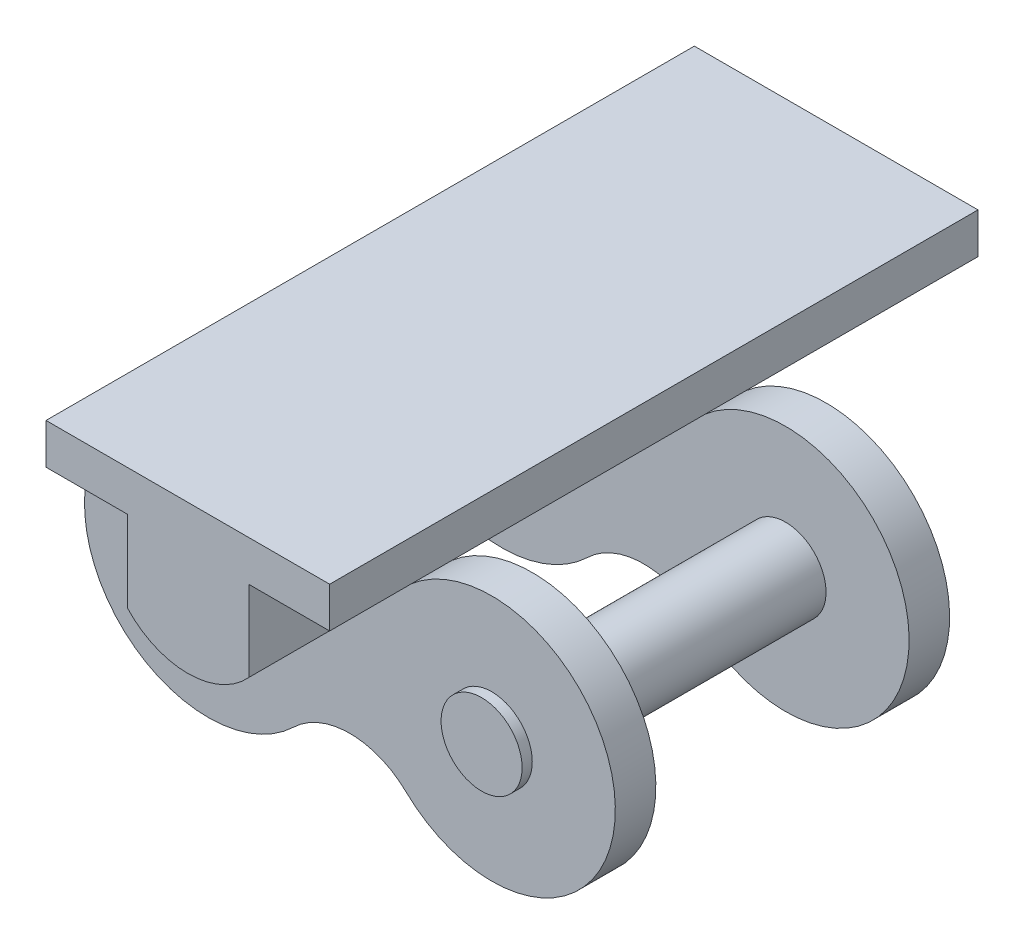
ISO-10303-21;
HEADER;
FILE_DESCRIPTION(('STEP AP214'),'2;1');
FILE_NAME('part.step','',(''),(''),'','','');
FILE_SCHEMA(('AUTOMOTIVE_DESIGN { 1 0 10303 214 1 1 1 1 }'));
ENDSEC;
DATA;
#1=APPLICATION_CONTEXT('core data for automotive mechanical design processes');
#2=APPLICATION_PROTOCOL_DEFINITION('international standard','automotive_design',2000,#1);
#3=PRODUCT_CONTEXT('',#1,'mechanical');
#4=PRODUCT('Part','Part','',(#3));
#5=PRODUCT_RELATED_PRODUCT_CATEGORY('part','',(#4));
#6=PRODUCT_DEFINITION_FORMATION('','',#4);
#7=PRODUCT_DEFINITION_CONTEXT('part definition',#1,'design');
#8=PRODUCT_DEFINITION('design','',#6,#7);
#9=PRODUCT_DEFINITION_SHAPE('','',#8);
#10=(LENGTH_UNIT() NAMED_UNIT(*) SI_UNIT(.MILLI.,.METRE.));
#11=(NAMED_UNIT(*) PLANE_ANGLE_UNIT() SI_UNIT($,.RADIAN.));
#12=(NAMED_UNIT(*) SI_UNIT($,.STERADIAN.) SOLID_ANGLE_UNIT());
#13=UNCERTAINTY_MEASURE_WITH_UNIT(LENGTH_MEASURE(1.E-05),#10,'distance_accuracy_value','');
#14=(GEOMETRIC_REPRESENTATION_CONTEXT(3) GLOBAL_UNCERTAINTY_ASSIGNED_CONTEXT((#13)) GLOBAL_UNIT_ASSIGNED_CONTEXT((#10,
#11,#12)) REPRESENTATION_CONTEXT('',''));
#15=CARTESIAN_POINT('',(0.,0.,0.));
#16=DIRECTION('',(0.,0.,1.));
#17=DIRECTION('',(1.,0.,0.));
#18=AXIS2_PLACEMENT_3D('',#15,#16,#17);
#19=CARTESIAN_POINT('',(3.5,3.64039832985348,2.));
#20=DIRECTION('',(0.,0.,1.));
#21=DIRECTION('',(1.,0.,0.));
#22=AXIS2_PLACEMENT_3D('',#19,#20,#21);
#23=PLANE('',#22);
#24=CARTESIAN_POINT('',(-7.,0.,2.));
#25=DIRECTION('',(0.,0.,1.));
#26=DIRECTION('',(1.,0.,0.));
#27=AXIS2_PLACEMENT_3D('',#24,#25,#26);
#28=CIRCLE('',#27,2.);
#29=CARTESIAN_POINT('',(-5.,0.,2.));
#30=VERTEX_POINT('',#29);
#31=EDGE_CURVE('E327',#30,#30,#28,.T.);
#32=ORIENTED_EDGE('',*,*,#31,.F.);
#33=EDGE_LOOP('',(#32));
#34=FACE_BOUND('',#33,.T.);
#35=CARTESIAN_POINT('',(7.,0.,2.));
#36=DIRECTION('',(0.,0.,1.));
#37=DIRECTION('',(-1.,0.,0.));
#38=AXIS2_PLACEMENT_3D('',#35,#36,#37);
#39=CIRCLE('',#38,2.);
#40=CARTESIAN_POINT('',(5.,0.,2.));
#41=VERTEX_POINT('',#40);
#42=EDGE_CURVE('E323',#41,#41,#39,.T.);
#43=ORIENTED_EDGE('',*,*,#42,.F.);
#44=EDGE_LOOP('',(#43));
#45=FACE_BOUND('',#44,.T.);
#46=CARTESIAN_POINT('',(7.,0.,2.));
#47=DIRECTION('',(0.,0.,1.));
#48=DIRECTION('',(-1.,0.,0.));
#49=AXIS2_PLACEMENT_3D('',#46,#47,#48);
#50=CIRCLE('',#49,6.1);
#51=CARTESIAN_POINT('',(2.77227722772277,-4.39731283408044,2.));
#52=VERTEX_POINT('',#51);
#53=CARTESIAN_POINT('',(3.01043166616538,4.6144712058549,2.));
#54=VERTEX_POINT('',#53);
#55=EDGE_CURVE('E339',#52,#54,#50,.T.);
#56=ORIENTED_EDGE('',*,*,#55,.T.);
#57=CARTESIAN_POINT('',(0.00217211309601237,7.34025454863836,2.));
#58=DIRECTION('',(0.,0.,1.));
#59=DIRECTION('',(1.,0.,0.));
#60=AXIS2_PLACEMENT_3D('',#57,#58,#59);
#61=CIRCLE('',#60,4.05949755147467);
#62=CARTESIAN_POINT('',(-2.98956833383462,4.59635049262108,2.));
#63=VERTEX_POINT('',#62);
#64=EDGE_CURVE('E55',#54,#63,#61,.F.);
#65=ORIENTED_EDGE('',*,*,#64,.T.);
#66=CARTESIAN_POINT('',(-7.,0.,2.));
#67=DIRECTION('',(0.,0.,1.));
#68=DIRECTION('',(1.,0.,0.));
#69=AXIS2_PLACEMENT_3D('',#66,#67,#68);
#70=CIRCLE('',#69,6.1);
#71=CARTESIAN_POINT('',(-2.77227722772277,-4.39731283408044,2.));
#72=VERTEX_POINT('',#71);
#73=EDGE_CURVE('E332',#63,#72,#70,.T.);
#74=ORIENTED_EDGE('',*,*,#73,.T.);
#75=CARTESIAN_POINT('',(0.,-7.28079665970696,2.));
#76=DIRECTION('',(0.,0.,-1.));
#77=DIRECTION('',(-1.,0.,0.));
#78=AXIS2_PLACEMENT_3D('',#75,#76,#77);
#79=CIRCLE('',#78,4.);
#80=EDGE_CURVE('E335',#72,#52,#79,.T.);
#81=ORIENTED_EDGE('',*,*,#80,.T.);
#82=EDGE_LOOP('',(#56,#65,#74,#81));
#83=FACE_BOUND('',#82,.T.);
#84=ADVANCED_FACE('F39',(#34,#45,#83),#23,.T.);
#85=CARTESIAN_POINT('',(3.5,3.64039832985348,0.));
#86=DIRECTION('',(0.,0.,1.));
#87=DIRECTION('',(1.,0.,0.));
#88=AXIS2_PLACEMENT_3D('',#85,#86,#87);
#89=PLANE('',#88);
#90=CARTESIAN_POINT('',(-7.,0.,0.));
#91=DIRECTION('',(0.,0.,1.));
#92=DIRECTION('',(1.,0.,0.));
#93=AXIS2_PLACEMENT_3D('',#90,#91,#92);
#94=CIRCLE('',#93,2.);
#95=CARTESIAN_POINT('',(-5.,0.,0.));
#96=VERTEX_POINT('',#95);
#97=EDGE_CURVE('E307',#96,#96,#94,.T.);
#98=ORIENTED_EDGE('',*,*,#97,.T.);
#99=EDGE_LOOP('',(#98));
#100=FACE_BOUND('',#99,.T.);
#101=CARTESIAN_POINT('',(7.,0.,0.));
#102=DIRECTION('',(0.,0.,1.));
#103=DIRECTION('',(1.,0.,0.));
#104=AXIS2_PLACEMENT_3D('',#101,#102,#103);
#105=CIRCLE('',#104,2.);
#106=CARTESIAN_POINT('',(9.,0.,0.));
#107=VERTEX_POINT('',#106);
#108=EDGE_CURVE('E319',#107,#107,#105,.T.);
#109=ORIENTED_EDGE('',*,*,#108,.T.);
#110=EDGE_LOOP('',(#109));
#111=FACE_BOUND('',#110,.T.);
#112=CARTESIAN_POINT('',(0.00217211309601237,7.34025454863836,0.));
#113=DIRECTION('',(0.,0.,1.));
#114=DIRECTION('',(1.,0.,0.));
#115=AXIS2_PLACEMENT_3D('',#112,#113,#114);
#116=CIRCLE('',#115,4.05949755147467);
#117=CARTESIAN_POINT('',(3.01043166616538,4.6144712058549,0.));
#118=VERTEX_POINT('',#117);
#119=CARTESIAN_POINT('',(-2.98956833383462,4.59635049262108,0.));
#120=VERTEX_POINT('',#119);
#121=EDGE_CURVE('E63',#118,#120,#116,.F.);
#122=ORIENTED_EDGE('',*,*,#121,.F.);
#123=CARTESIAN_POINT('',(7.,0.,0.));
#124=DIRECTION('',(0.,0.,1.));
#125=DIRECTION('',(-1.,0.,0.));
#126=AXIS2_PLACEMENT_3D('',#123,#124,#125);
#127=CIRCLE('',#126,6.1);
#128=CARTESIAN_POINT('',(2.77227722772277,-4.39731283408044,0.));
#129=VERTEX_POINT('',#128);
#130=EDGE_CURVE('E336',#129,#118,#127,.T.);
#131=ORIENTED_EDGE('',*,*,#130,.F.);
#132=CARTESIAN_POINT('',(0.,-7.28079665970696,0.));
#133=DIRECTION('',(0.,0.,-1.));
#134=DIRECTION('',(-1.,0.,0.));
#135=AXIS2_PLACEMENT_3D('',#132,#133,#134);
#136=CIRCLE('',#135,4.);
#137=CARTESIAN_POINT('',(-2.77227722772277,-4.39731283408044,0.));
#138=VERTEX_POINT('',#137);
#139=EDGE_CURVE('E345',#138,#129,#136,.T.);
#140=ORIENTED_EDGE('',*,*,#139,.F.);
#141=CARTESIAN_POINT('',(-7.,0.,0.));
#142=DIRECTION('',(0.,0.,1.));
#143=DIRECTION('',(1.,0.,0.));
#144=AXIS2_PLACEMENT_3D('',#141,#142,#143);
#145=CIRCLE('',#144,6.1);
#146=EDGE_CURVE('E331',#120,#138,#145,.T.);
#147=ORIENTED_EDGE('',*,*,#146,.F.);
#148=EDGE_LOOP('',(#122,#131,#140,#147));
#149=FACE_BOUND('',#148,.T.);
#150=ADVANCED_FACE('F377',(#100,#111,#149),#89,.F.);
#151=CARTESIAN_POINT('',(-7.,0.,2.));
#152=DIRECTION('',(0.,0.,-1.));
#153=DIRECTION('',(-1.,0.,0.));
#154=AXIS2_PLACEMENT_3D('',#151,#152,#153);
#155=CYLINDRICAL_SURFACE('',#154,6.1);
#156=DIRECTION('',(0.,0.,-1.));
#157=VECTOR('',#156,1.);
#158=CARTESIAN_POINT('',(-2.98956833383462,4.59635049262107,24.5));
#159=LINE('',#158,#157);
#160=EDGE_CURVE('E400',#63,#120,#159,.T.);
#161=ORIENTED_EDGE('',*,*,#160,.T.);
#162=ORIENTED_EDGE('',*,*,#146,.T.);
#163=DIRECTION('',(0.,0.,-1.));
#164=VECTOR('',#163,1.);
#165=CARTESIAN_POINT('',(-2.77227722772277,-4.39731283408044,2.));
#166=LINE('',#165,#164);
#167=EDGE_CURVE('E353',#72,#138,#166,.T.);
#168=ORIENTED_EDGE('',*,*,#167,.F.);
#169=ORIENTED_EDGE('',*,*,#73,.F.);
#170=EDGE_LOOP('',(#161,#162,#168,#169));
#171=FACE_BOUND('',#170,.T.);
#172=ADVANCED_FACE('F41',(#171),#155,.T.);
#173=CARTESIAN_POINT('',(7.,0.,2.));
#174=DIRECTION('',(0.,0.,-1.));
#175=DIRECTION('',(-1.,0.,0.));
#176=AXIS2_PLACEMENT_3D('',#173,#174,#175);
#177=CYLINDRICAL_SURFACE('',#176,6.1);
#178=DIRECTION('',(0.,0.,-1.));
#179=VECTOR('',#178,1.);
#180=CARTESIAN_POINT('',(3.01043166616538,4.6144712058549,24.5));
#181=LINE('',#180,#179);
#182=EDGE_CURVE('E162',#54,#118,#181,.T.);
#183=ORIENTED_EDGE('',*,*,#182,.F.);
#184=ORIENTED_EDGE('',*,*,#55,.F.);
#185=DIRECTION('',(0.,0.,-1.));
#186=VECTOR('',#185,1.);
#187=CARTESIAN_POINT('',(2.77227722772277,-4.39731283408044,2.));
#188=LINE('',#187,#186);
#189=EDGE_CURVE('E342',#52,#129,#188,.T.);
#190=ORIENTED_EDGE('',*,*,#189,.T.);
#191=ORIENTED_EDGE('',*,*,#130,.T.);
#192=EDGE_LOOP('',(#183,#184,#190,#191));
#193=FACE_BOUND('',#192,.T.);
#194=ADVANCED_FACE('F477',(#193),#177,.T.);
#195=CARTESIAN_POINT('',(7.,0.,14.5));
#196=DIRECTION('',(0.,0.,1.));
#197=DIRECTION('',(1.,0.,0.));
#198=AXIS2_PLACEMENT_3D('',#195,#196,#197);
#199=CYLINDRICAL_SURFACE('',#198,6.1);
#200=CARTESIAN_POINT('',(7.,0.,14.5));
#201=DIRECTION('',(0.,0.,1.));
#202=DIRECTION('',(-1.,0.,0.));
#203=AXIS2_PLACEMENT_3D('',#200,#201,#202);
#204=CIRCLE('',#203,6.1);
#205=CARTESIAN_POINT('',(2.77227722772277,-4.39731283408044,14.5));
#206=VERTEX_POINT('',#205);
#207=CARTESIAN_POINT('',(3.01043166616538,4.61447120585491,14.5));
#208=VERTEX_POINT('',#207);
#209=EDGE_CURVE('E272',#206,#208,#204,.T.);
#210=ORIENTED_EDGE('',*,*,#209,.T.);
#211=CARTESIAN_POINT('',(3.01043166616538,4.6144712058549,16.5));
#212=VERTEX_POINT('',#211);
#213=EDGE_CURVE('E256',#212,#208,#181,.T.);
#214=ORIENTED_EDGE('',*,*,#213,.F.);
#215=CARTESIAN_POINT('',(7.,0.,16.5));
#216=DIRECTION('',(0.,0.,1.));
#217=DIRECTION('',(-1.,0.,0.));
#218=AXIS2_PLACEMENT_3D('',#215,#216,#217);
#219=CIRCLE('',#218,6.1);
#220=CARTESIAN_POINT('',(2.77227722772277,-4.39731283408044,16.5));
#221=VERTEX_POINT('',#220);
#222=EDGE_CURVE('E271',#221,#212,#219,.T.);
#223=ORIENTED_EDGE('',*,*,#222,.F.);
#224=DIRECTION('',(0.,0.,1.));
#225=VECTOR('',#224,1.);
#226=CARTESIAN_POINT('',(2.77227722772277,-4.39731283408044,14.5));
#227=LINE('',#226,#225);
#228=EDGE_CURVE('E296',#206,#221,#227,.T.);
#229=ORIENTED_EDGE('',*,*,#228,.F.);
#230=EDGE_LOOP('',(#210,#214,#223,#229));
#231=FACE_BOUND('',#230,.T.);
#232=ADVANCED_FACE('F456',(#231),#199,.T.);
#233=CARTESIAN_POINT('',(-7.,0.,14.5));
#234=DIRECTION('',(0.,0.,1.));
#235=DIRECTION('',(1.,0.,0.));
#236=AXIS2_PLACEMENT_3D('',#233,#234,#235);
#237=CYLINDRICAL_SURFACE('',#236,6.1);
#238=CARTESIAN_POINT('',(-7.,0.,16.5));
#239=DIRECTION('',(0.,0.,1.));
#240=DIRECTION('',(1.,0.,0.));
#241=AXIS2_PLACEMENT_3D('',#238,#239,#240);
#242=CIRCLE('',#241,6.1);
#243=CARTESIAN_POINT('',(-2.98956833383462,4.59635049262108,16.5));
#244=VERTEX_POINT('',#243);
#245=CARTESIAN_POINT('',(-2.77227722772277,-4.39731283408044,16.5));
#246=VERTEX_POINT('',#245);
#247=EDGE_CURVE('E277',#244,#246,#242,.T.);
#248=ORIENTED_EDGE('',*,*,#247,.F.);
#249=CARTESIAN_POINT('',(-2.98956833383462,4.59635049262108,14.5));
#250=VERTEX_POINT('',#249);
#251=EDGE_CURVE('E237',#244,#250,#159,.T.);
#252=ORIENTED_EDGE('',*,*,#251,.T.);
#253=CARTESIAN_POINT('',(-7.,0.,14.5));
#254=DIRECTION('',(0.,0.,1.));
#255=DIRECTION('',(1.,0.,0.));
#256=AXIS2_PLACEMENT_3D('',#253,#254,#255);
#257=CIRCLE('',#256,6.1);
#258=CARTESIAN_POINT('',(-2.77227722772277,-4.39731283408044,14.5));
#259=VERTEX_POINT('',#258);
#260=EDGE_CURVE('E281',#250,#259,#257,.T.);
#261=ORIENTED_EDGE('',*,*,#260,.T.);
#262=DIRECTION('',(0.,0.,1.));
#263=VECTOR('',#262,1.);
#264=CARTESIAN_POINT('',(-2.77227722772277,-4.39731283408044,14.5));
#265=LINE('',#264,#263);
#266=EDGE_CURVE('E284',#259,#246,#265,.T.);
#267=ORIENTED_EDGE('',*,*,#266,.T.);
#268=EDGE_LOOP('',(#248,#252,#261,#267));
#269=FACE_BOUND('',#268,.T.);
#270=ADVANCED_FACE('F447',(#269),#237,.T.);
#271=CARTESIAN_POINT('',(3.5,3.64039832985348,14.5));
#272=DIRECTION('',(0.,0.,-1.));
#273=DIRECTION('',(1.,0.,0.));
#274=AXIS2_PLACEMENT_3D('',#271,#272,#273);
#275=PLANE('',#274);
#276=CARTESIAN_POINT('',(7.,0.,14.5));
#277=DIRECTION('',(0.,0.,-1.));
#278=DIRECTION('',(-1.,0.,0.));
#279=AXIS2_PLACEMENT_3D('',#276,#277,#278);
#280=CIRCLE('',#279,2.);
#281=CARTESIAN_POINT('',(5.,0.,14.5));
#282=VERTEX_POINT('',#281);
#283=EDGE_CURVE('E48',#282,#282,#280,.F.);
#284=ORIENTED_EDGE('',*,*,#283,.T.);
#285=EDGE_LOOP('',(#284));
#286=FACE_BOUND('',#285,.T.);
#287=CARTESIAN_POINT('',(-7.,0.,14.5));
#288=DIRECTION('',(0.,0.,-1.));
#289=DIRECTION('',(-1.,0.,0.));
#290=AXIS2_PLACEMENT_3D('',#287,#288,#289);
#291=CIRCLE('',#290,2.);
#292=CARTESIAN_POINT('',(-9.,0.,14.5));
#293=VERTEX_POINT('',#292);
#294=EDGE_CURVE('E357',#293,#293,#291,.F.);
#295=ORIENTED_EDGE('',*,*,#294,.T.);
#296=EDGE_LOOP('',(#295));
#297=FACE_BOUND('',#296,.T.);
#298=ORIENTED_EDGE('',*,*,#260,.F.);
#299=CARTESIAN_POINT('',(0.00217211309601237,7.34025454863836,14.5));
#300=DIRECTION('',(0.,0.,-1.));
#301=DIRECTION('',(-1.,0.,0.));
#302=AXIS2_PLACEMENT_3D('',#299,#300,#301);
#303=CIRCLE('',#302,4.05949755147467);
#304=EDGE_CURVE('E255',#250,#208,#303,.F.);
#305=ORIENTED_EDGE('',*,*,#304,.T.);
#306=ORIENTED_EDGE('',*,*,#209,.F.);
#307=CARTESIAN_POINT('',(0.,-7.28079665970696,14.5));
#308=DIRECTION('',(0.,0.,-1.));
#309=DIRECTION('',(-1.,0.,0.));
#310=AXIS2_PLACEMENT_3D('',#307,#308,#309);
#311=CIRCLE('',#310,4.);
#312=EDGE_CURVE('E276',#259,#206,#311,.T.);
#313=ORIENTED_EDGE('',*,*,#312,.F.);
#314=EDGE_LOOP('',(#298,#305,#306,#313));
#315=FACE_BOUND('',#314,.T.);
#316=ADVANCED_FACE('F364',(#286,#297,#315),#275,.T.);
#317=CARTESIAN_POINT('',(3.5,3.64039832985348,16.5));
#318=DIRECTION('',(0.,0.,-1.));
#319=DIRECTION('',(1.,0.,0.));
#320=AXIS2_PLACEMENT_3D('',#317,#318,#319);
#321=PLANE('',#320);
#322=CARTESIAN_POINT('',(7.,0.,16.5));
#323=DIRECTION('',(0.,0.,1.));
#324=DIRECTION('',(-1.,0.,0.));
#325=AXIS2_PLACEMENT_3D('',#322,#323,#324);
#326=CIRCLE('',#325,2.);
#327=CARTESIAN_POINT('',(5.,0.,16.5));
#328=VERTEX_POINT('',#327);
#329=EDGE_CURVE('E263',#328,#328,#326,.T.);
#330=ORIENTED_EDGE('',*,*,#329,.F.);
#331=EDGE_LOOP('',(#330));
#332=FACE_BOUND('',#331,.T.);
#333=CARTESIAN_POINT('',(-7.,0.,16.5));
#334=DIRECTION('',(0.,0.,1.));
#335=DIRECTION('',(1.,0.,0.));
#336=AXIS2_PLACEMENT_3D('',#333,#334,#335);
#337=CIRCLE('',#336,2.);
#338=CARTESIAN_POINT('',(-5.,0.,16.5));
#339=VERTEX_POINT('',#338);
#340=EDGE_CURVE('E267',#339,#339,#337,.T.);
#341=ORIENTED_EDGE('',*,*,#340,.F.);
#342=EDGE_LOOP('',(#341));
#343=FACE_BOUND('',#342,.T.);
#344=CARTESIAN_POINT('',(0.00217211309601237,7.34025454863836,16.5));
#345=DIRECTION('',(0.,0.,-1.));
#346=DIRECTION('',(-1.,0.,0.));
#347=AXIS2_PLACEMENT_3D('',#344,#345,#346);
#348=CIRCLE('',#347,4.05949755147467);
#349=EDGE_CURVE('E11',#244,#212,#348,.F.);
#350=ORIENTED_EDGE('',*,*,#349,.F.);
#351=ORIENTED_EDGE('',*,*,#247,.T.);
#352=CARTESIAN_POINT('',(0.,-7.28079665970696,16.5));
#353=DIRECTION('',(0.,0.,-1.));
#354=DIRECTION('',(-1.,0.,0.));
#355=AXIS2_PLACEMENT_3D('',#352,#353,#354);
#356=CIRCLE('',#355,4.);
#357=EDGE_CURVE('E287',#246,#221,#356,.T.);
#358=ORIENTED_EDGE('',*,*,#357,.T.);
#359=ORIENTED_EDGE('',*,*,#222,.T.);
#360=EDGE_LOOP('',(#350,#351,#358,#359));
#361=FACE_BOUND('',#360,.T.);
#362=ADVANCED_FACE('F443',(#332,#343,#361),#321,.F.);
#363=CARTESIAN_POINT('',(0.,-7.28079665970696,2.));
#364=DIRECTION('',(0.,0.,-1.));
#365=DIRECTION('',(-1.,0.,0.));
#366=AXIS2_PLACEMENT_3D('',#363,#364,#365);
#367=CYLINDRICAL_SURFACE('',#366,4.);
#368=ORIENTED_EDGE('',*,*,#139,.T.);
#369=ORIENTED_EDGE('',*,*,#189,.F.);
#370=ORIENTED_EDGE('',*,*,#80,.F.);
#371=ORIENTED_EDGE('',*,*,#167,.T.);
#372=EDGE_LOOP('',(#368,#369,#370,#371));
#373=FACE_BOUND('',#372,.T.);
#374=ADVANCED_FACE('F464',(#373),#367,.F.);
#375=CARTESIAN_POINT('',(7.,0.,-0.5));
#376=DIRECTION('',(0.,0.,1.));
#377=DIRECTION('',(1.,0.,0.));
#378=AXIS2_PLACEMENT_3D('',#375,#376,#377);
#379=PLANE('',#378);
#380=CARTESIAN_POINT('',(7.,0.,-0.5));
#381=DIRECTION('',(0.,0.,1.));
#382=DIRECTION('',(1.,0.,0.));
#383=AXIS2_PLACEMENT_3D('',#380,#381,#382);
#384=CIRCLE('',#383,2.);
#385=CARTESIAN_POINT('',(9.,0.,-0.5));
#386=VERTEX_POINT('',#385);
#387=EDGE_CURVE('E315',#386,#386,#384,.T.);
#388=ORIENTED_EDGE('',*,*,#387,.F.);
#389=EDGE_LOOP('',(#388));
#390=FACE_BOUND('',#389,.T.);
#391=ADVANCED_FACE('F493',(#390),#379,.F.);
#392=CARTESIAN_POINT('',(7.,0.,-0.5));
#393=DIRECTION('',(0.,0.,1.));
#394=DIRECTION('',(1.,0.,0.));
#395=AXIS2_PLACEMENT_3D('',#392,#393,#394);
#396=CYLINDRICAL_SURFACE('',#395,2.);
#397=ORIENTED_EDGE('',*,*,#387,.T.);
#398=EDGE_LOOP('',(#397));
#399=FACE_BOUND('',#398,.T.);
#400=ORIENTED_EDGE('',*,*,#108,.F.);
#401=EDGE_LOOP('',(#400));
#402=FACE_BOUND('',#401,.T.);
#403=ADVANCED_FACE('F371',(#399,#402),#396,.T.);
#404=ORIENTED_EDGE('',*,*,#283,.F.);
#405=EDGE_LOOP('',(#404));
#406=FACE_BOUND('',#405,.T.);
#407=ORIENTED_EDGE('',*,*,#42,.T.);
#408=EDGE_LOOP('',(#407));
#409=FACE_BOUND('',#408,.T.);
#410=ADVANCED_FACE('F367',(#406,#409),#396,.T.);
#411=CARTESIAN_POINT('',(-7.,0.,-0.5));
#412=DIRECTION('',(0.,0.,1.));
#413=DIRECTION('',(1.,0.,0.));
#414=AXIS2_PLACEMENT_3D('',#411,#412,#413);
#415=PLANE('',#414);
#416=CARTESIAN_POINT('',(-7.,0.,-0.5));
#417=DIRECTION('',(0.,0.,1.));
#418=DIRECTION('',(1.,0.,0.));
#419=AXIS2_PLACEMENT_3D('',#416,#417,#418);
#420=CIRCLE('',#419,2.);
#421=CARTESIAN_POINT('',(-5.,0.,-0.5));
#422=VERTEX_POINT('',#421);
#423=EDGE_CURVE('E303',#422,#422,#420,.T.);
#424=ORIENTED_EDGE('',*,*,#423,.F.);
#425=EDGE_LOOP('',(#424));
#426=FACE_BOUND('',#425,.T.);
#427=ADVANCED_FACE('F370',(#426),#415,.F.);
#428=CARTESIAN_POINT('',(-7.,0.,-0.5));
#429=DIRECTION('',(0.,0.,1.));
#430=DIRECTION('',(1.,0.,0.));
#431=AXIS2_PLACEMENT_3D('',#428,#429,#430);
#432=CYLINDRICAL_SURFACE('',#431,2.);
#433=ORIENTED_EDGE('',*,*,#423,.T.);
#434=EDGE_LOOP('',(#433));
#435=FACE_BOUND('',#434,.T.);
#436=ORIENTED_EDGE('',*,*,#97,.F.);
#437=EDGE_LOOP('',(#436));
#438=FACE_BOUND('',#437,.T.);
#439=ADVANCED_FACE('F485',(#435,#438),#432,.T.);
#440=ORIENTED_EDGE('',*,*,#294,.F.);
#441=EDGE_LOOP('',(#440));
#442=FACE_BOUND('',#441,.T.);
#443=ORIENTED_EDGE('',*,*,#31,.T.);
#444=EDGE_LOOP('',(#443));
#445=FACE_BOUND('',#444,.T.);
#446=ADVANCED_FACE('F474',(#442,#445),#432,.T.);
#447=CARTESIAN_POINT('',(0.,-7.28079665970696,14.5));
#448=DIRECTION('',(0.,0.,1.));
#449=DIRECTION('',(1.,0.,0.));
#450=AXIS2_PLACEMENT_3D('',#447,#448,#449);
#451=CYLINDRICAL_SURFACE('',#450,4.);
#452=ORIENTED_EDGE('',*,*,#357,.F.);
#453=ORIENTED_EDGE('',*,*,#266,.F.);
#454=ORIENTED_EDGE('',*,*,#312,.T.);
#455=ORIENTED_EDGE('',*,*,#228,.T.);
#456=EDGE_LOOP('',(#452,#453,#454,#455));
#457=FACE_BOUND('',#456,.T.);
#458=ADVANCED_FACE('F453',(#457),#451,.F.);
#459=CARTESIAN_POINT('',(7.,0.,17.));
#460=DIRECTION('',(0.,0.,1.));
#461=DIRECTION('',(1.,0.,0.));
#462=AXIS2_PLACEMENT_3D('',#459,#460,#461);
#463=PLANE('',#462);
#464=CARTESIAN_POINT('',(7.,0.,17.));
#465=DIRECTION('',(0.,0.,1.));
#466=DIRECTION('',(1.,0.,0.));
#467=AXIS2_PLACEMENT_3D('',#464,#465,#466);
#468=CIRCLE('',#467,2.);
#469=CARTESIAN_POINT('',(9.,0.,17.));
#470=VERTEX_POINT('',#469);
#471=EDGE_CURVE('E311',#470,#470,#468,.T.);
#472=ORIENTED_EDGE('',*,*,#471,.T.);
#473=EDGE_LOOP('',(#472));
#474=FACE_BOUND('',#473,.T.);
#475=ADVANCED_FACE('F473',(#474),#463,.T.);
#476=ORIENTED_EDGE('',*,*,#471,.F.);
#477=EDGE_LOOP('',(#476));
#478=FACE_BOUND('',#477,.T.);
#479=ORIENTED_EDGE('',*,*,#329,.T.);
#480=EDGE_LOOP('',(#479));
#481=FACE_BOUND('',#480,.T.);
#482=ADVANCED_FACE('F373',(#478,#481),#396,.T.);
#483=CARTESIAN_POINT('',(-7.,0.,17.));
#484=DIRECTION('',(0.,0.,1.));
#485=DIRECTION('',(1.,0.,0.));
#486=AXIS2_PLACEMENT_3D('',#483,#484,#485);
#487=PLANE('',#486);
#488=CARTESIAN_POINT('',(-7.,0.,17.));
#489=DIRECTION('',(0.,0.,1.));
#490=DIRECTION('',(1.,0.,0.));
#491=AXIS2_PLACEMENT_3D('',#488,#489,#490);
#492=CIRCLE('',#491,2.);
#493=CARTESIAN_POINT('',(-5.,0.,17.));
#494=VERTEX_POINT('',#493);
#495=EDGE_CURVE('E299',#494,#494,#492,.T.);
#496=ORIENTED_EDGE('',*,*,#495,.T.);
#497=EDGE_LOOP('',(#496));
#498=FACE_BOUND('',#497,.T.);
#499=ADVANCED_FACE('F478',(#498),#487,.T.);
#500=ORIENTED_EDGE('',*,*,#495,.F.);
#501=EDGE_LOOP('',(#500));
#502=FACE_BOUND('',#501,.T.);
#503=ORIENTED_EDGE('',*,*,#340,.T.);
#504=EDGE_LOOP('',(#503));
#505=FACE_BOUND('',#504,.T.);
#506=ADVANCED_FACE('F481',(#502,#505),#432,.T.);
#507=CARTESIAN_POINT('',(0.00217211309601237,7.34025454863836,24.5));
#508=DIRECTION('',(0.,0.,-1.));
#509=DIRECTION('',(-1.,0.,0.));
#510=AXIS2_PLACEMENT_3D('',#507,#508,#509);
#511=CYLINDRICAL_SURFACE('',#510,4.05949755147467);
#512=CARTESIAN_POINT('',(3.01043166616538,4.6144712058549,-7.5));
#513=VERTEX_POINT('',#512);
#514=EDGE_CURVE('E155',#118,#513,#181,.T.);
#515=ORIENTED_EDGE('',*,*,#514,.F.);
#516=ORIENTED_EDGE('',*,*,#121,.T.);
#517=CARTESIAN_POINT('',(-2.98956833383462,4.59635049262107,-7.5));
#518=VERTEX_POINT('',#517);
#519=EDGE_CURVE('E182',#120,#518,#159,.T.);
#520=ORIENTED_EDGE('',*,*,#519,.T.);
#521=CARTESIAN_POINT('',(0.00217211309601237,7.34025454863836,-7.5));
#522=DIRECTION('',(0.,0.,1.));
#523=DIRECTION('',(1.,0.,0.));
#524=AXIS2_PLACEMENT_3D('',#521,#522,#523);
#525=CIRCLE('',#524,4.05949755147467);
#526=EDGE_CURVE('E173',#518,#513,#525,.T.);
#527=ORIENTED_EDGE('',*,*,#526,.T.);
#528=EDGE_LOOP('',(#515,#516,#520,#527));
#529=FACE_BOUND('',#528,.T.);
#530=ADVANCED_FACE('F180',(#529),#511,.T.);
#531=CARTESIAN_POINT('',(-2.98956833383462,4.59635049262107,24.5));
#532=VERTEX_POINT('',#531);
#533=EDGE_CURVE('E232',#532,#244,#159,.T.);
#534=ORIENTED_EDGE('',*,*,#533,.T.);
#535=ORIENTED_EDGE('',*,*,#349,.T.);
#536=CARTESIAN_POINT('',(3.01043166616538,4.6144712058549,24.5));
#537=VERTEX_POINT('',#536);
#538=EDGE_CURVE('E167',#537,#212,#181,.T.);
#539=ORIENTED_EDGE('',*,*,#538,.F.);
#540=CARTESIAN_POINT('',(0.00217211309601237,7.34025454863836,24.5));
#541=DIRECTION('',(0.,0.,1.));
#542=DIRECTION('',(1.,0.,0.));
#543=AXIS2_PLACEMENT_3D('',#540,#541,#542);
#544=CIRCLE('',#543,4.05949755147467);
#545=EDGE_CURVE('E207',#532,#537,#544,.T.);
#546=ORIENTED_EDGE('',*,*,#545,.F.);
#547=EDGE_LOOP('',(#534,#535,#539,#546));
#548=FACE_BOUND('',#547,.T.);
#549=ADVANCED_FACE('F440',(#548),#511,.T.);
#550=ORIENTED_EDGE('',*,*,#64,.F.);
#551=EDGE_CURVE('E388',#208,#54,#181,.T.);
#552=ORIENTED_EDGE('',*,*,#551,.F.);
#553=ORIENTED_EDGE('',*,*,#304,.F.);
#554=EDGE_CURVE('E391',#250,#63,#159,.T.);
#555=ORIENTED_EDGE('',*,*,#554,.T.);
#556=EDGE_LOOP('',(#550,#552,#553,#555));
#557=FACE_BOUND('',#556,.T.);
#558=ADVANCED_FACE('F387',(#557),#511,.T.);
#559=CARTESIAN_POINT('',(3.01043166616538,4.6144712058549,24.5));
#560=DIRECTION('',(-1.,0.,0.));
#561=DIRECTION('',(0.,-1.,0.));
#562=AXIS2_PLACEMENT_3D('',#559,#560,#561);
#563=PLANE('',#562);
#564=ORIENTED_EDGE('',*,*,#538,.T.);
#565=ORIENTED_EDGE('',*,*,#213,.T.);
#566=ORIENTED_EDGE('',*,*,#551,.T.);
#567=ORIENTED_EDGE('',*,*,#182,.T.);
#568=ORIENTED_EDGE('',*,*,#514,.T.);
#569=DIRECTION('',(0.,1.,0.));
#570=VECTOR('',#569,1.);
#571=CARTESIAN_POINT('',(3.01043166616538,4.6144712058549,-7.5));
#572=LINE('',#571,#570);
#573=CARTESIAN_POINT('',(3.01043166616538,8.59635049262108,-7.5));
#574=VERTEX_POINT('',#573);
#575=EDGE_CURVE('E160',#513,#574,#572,.T.);
#576=ORIENTED_EDGE('',*,*,#575,.T.);
#577=DIRECTION('',(0.,0.,-1.));
#578=VECTOR('',#577,1.);
#579=CARTESIAN_POINT('',(3.01043166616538,8.59635049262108,24.5));
#580=LINE('',#579,#578);
#581=CARTESIAN_POINT('',(3.01043166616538,8.59635049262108,24.5));
#582=VERTEX_POINT('',#581);
#583=EDGE_CURVE('E165',#582,#574,#580,.T.);
#584=ORIENTED_EDGE('',*,*,#583,.F.);
#585=DIRECTION('',(0.,1.,0.));
#586=VECTOR('',#585,1.);
#587=CARTESIAN_POINT('',(3.01043166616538,4.6144712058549,24.5));
#588=LINE('',#587,#586);
#589=EDGE_CURVE('E211',#537,#582,#588,.T.);
#590=ORIENTED_EDGE('',*,*,#589,.F.);
#591=EDGE_LOOP('',(#564,#565,#566,#567,#568,#576,#584,#590));
#592=FACE_BOUND('',#591,.T.);
#593=ADVANCED_FACE('F158',(#592),#563,.F.);
#594=CARTESIAN_POINT('',(3.01043166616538,8.59635049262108,24.5));
#595=DIRECTION('',(0.,1.,0.));
#596=DIRECTION('',(0.,0.,1.));
#597=AXIS2_PLACEMENT_3D('',#594,#595,#596);
#598=PLANE('',#597);
#599=ORIENTED_EDGE('',*,*,#583,.T.);
#600=DIRECTION('',(1.,0.,0.));
#601=VECTOR('',#600,1.);
#602=CARTESIAN_POINT('',(3.01043166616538,8.59635049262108,-7.5));
#603=LINE('',#602,#601);
#604=CARTESIAN_POINT('',(7.,8.59635049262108,-7.5));
#605=VERTEX_POINT('',#604);
#606=EDGE_CURVE('E177',#574,#605,#603,.T.);
#607=ORIENTED_EDGE('',*,*,#606,.T.);
#608=DIRECTION('',(0.,0.,-1.));
#609=VECTOR('',#608,1.);
#610=CARTESIAN_POINT('',(7.,8.59635049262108,24.5));
#611=LINE('',#610,#609);
#612=CARTESIAN_POINT('',(7.,8.59635049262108,24.5));
#613=VERTEX_POINT('',#612);
#614=EDGE_CURVE('E249',#613,#605,#611,.T.);
#615=ORIENTED_EDGE('',*,*,#614,.F.);
#616=DIRECTION('',(1.,0.,0.));
#617=VECTOR('',#616,1.);
#618=CARTESIAN_POINT('',(3.01043166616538,8.59635049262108,24.5));
#619=LINE('',#618,#617);
#620=EDGE_CURVE('E214',#582,#613,#619,.T.);
#621=ORIENTED_EDGE('',*,*,#620,.F.);
#622=EDGE_LOOP('',(#599,#607,#615,#621));
#623=FACE_BOUND('',#622,.T.);
#624=ADVANCED_FACE('F433',(#623),#598,.F.);
#625=CARTESIAN_POINT('',(7.,8.59635049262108,24.5));
#626=DIRECTION('',(-1.,0.,0.));
#627=DIRECTION('',(0.,0.,1.));
#628=AXIS2_PLACEMENT_3D('',#625,#626,#627);
#629=PLANE('',#628);
#630=ORIENTED_EDGE('',*,*,#614,.T.);
#631=DIRECTION('',(0.,1.,0.));
#632=VECTOR('',#631,1.);
#633=CARTESIAN_POINT('',(7.,8.59635049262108,-7.5));
#634=LINE('',#633,#632);
#635=CARTESIAN_POINT('',(7.,10.5963504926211,-7.5));
#636=VERTEX_POINT('',#635);
#637=EDGE_CURVE('E188',#605,#636,#634,.T.);
#638=ORIENTED_EDGE('',*,*,#637,.T.);
#639=DIRECTION('',(0.,0.,-1.));
#640=VECTOR('',#639,1.);
#641=CARTESIAN_POINT('',(7.,10.5963504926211,24.5));
#642=LINE('',#641,#640);
#643=CARTESIAN_POINT('',(7.,10.5963504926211,24.5));
#644=VERTEX_POINT('',#643);
#645=EDGE_CURVE('E246',#644,#636,#642,.T.);
#646=ORIENTED_EDGE('',*,*,#645,.F.);
#647=DIRECTION('',(0.,1.,0.));
#648=VECTOR('',#647,1.);
#649=CARTESIAN_POINT('',(7.,8.59635049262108,24.5));
#650=LINE('',#649,#648);
#651=EDGE_CURVE('E217',#613,#644,#650,.T.);
#652=ORIENTED_EDGE('',*,*,#651,.F.);
#653=EDGE_LOOP('',(#630,#638,#646,#652));
#654=FACE_BOUND('',#653,.T.);
#655=ADVANCED_FACE('F428',(#654),#629,.F.);
#656=CARTESIAN_POINT('',(-7.,10.5963504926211,24.5));
#657=DIRECTION('',(0.,-1.,0.));
#658=DIRECTION('',(0.,0.,-1.));
#659=AXIS2_PLACEMENT_3D('',#656,#657,#658);
#660=PLANE('',#659);
#661=ORIENTED_EDGE('',*,*,#645,.T.);
#662=DIRECTION('',(-1.,0.,0.));
#663=VECTOR('',#662,1.);
#664=CARTESIAN_POINT('',(-7.,10.5963504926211,-7.5));
#665=LINE('',#664,#663);
#666=CARTESIAN_POINT('',(-7.,10.5963504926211,-7.5));
#667=VERTEX_POINT('',#666);
#668=EDGE_CURVE('E192',#636,#667,#665,.T.);
#669=ORIENTED_EDGE('',*,*,#668,.T.);
#670=DIRECTION('',(0.,0.,-1.));
#671=VECTOR('',#670,1.);
#672=CARTESIAN_POINT('',(-7.,10.5963504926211,24.5));
#673=LINE('',#672,#671);
#674=CARTESIAN_POINT('',(-7.,10.5963504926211,24.5));
#675=VERTEX_POINT('',#674);
#676=EDGE_CURVE('E243',#675,#667,#673,.T.);
#677=ORIENTED_EDGE('',*,*,#676,.F.);
#678=DIRECTION('',(-1.,0.,0.));
#679=VECTOR('',#678,1.);
#680=CARTESIAN_POINT('',(-7.,10.5963504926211,24.5));
#681=LINE('',#680,#679);
#682=EDGE_CURVE('E220',#644,#675,#681,.T.);
#683=ORIENTED_EDGE('',*,*,#682,.F.);
#684=EDGE_LOOP('',(#661,#669,#677,#683));
#685=FACE_BOUND('',#684,.T.);
#686=ADVANCED_FACE('F425',(#685),#660,.F.);
#687=CARTESIAN_POINT('',(-7.,8.59635049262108,24.5));
#688=DIRECTION('',(1.,0.,0.));
#689=DIRECTION('',(0.,0.,-1.));
#690=AXIS2_PLACEMENT_3D('',#687,#688,#689);
#691=PLANE('',#690);
#692=ORIENTED_EDGE('',*,*,#676,.T.);
#693=DIRECTION('',(0.,-1.,0.));
#694=VECTOR('',#693,1.);
#695=CARTESIAN_POINT('',(-7.,8.59635049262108,-7.5));
#696=LINE('',#695,#694);
#697=CARTESIAN_POINT('',(-7.,8.59635049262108,-7.5));
#698=VERTEX_POINT('',#697);
#699=EDGE_CURVE('E196',#667,#698,#696,.T.);
#700=ORIENTED_EDGE('',*,*,#699,.T.);
#701=DIRECTION('',(0.,0.,-1.));
#702=VECTOR('',#701,1.);
#703=CARTESIAN_POINT('',(-7.,8.59635049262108,24.5));
#704=LINE('',#703,#702);
#705=CARTESIAN_POINT('',(-7.,8.59635049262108,24.5));
#706=VERTEX_POINT('',#705);
#707=EDGE_CURVE('E240',#706,#698,#704,.T.);
#708=ORIENTED_EDGE('',*,*,#707,.F.);
#709=DIRECTION('',(0.,-1.,0.));
#710=VECTOR('',#709,1.);
#711=CARTESIAN_POINT('',(-7.,8.59635049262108,24.5));
#712=LINE('',#711,#710);
#713=EDGE_CURVE('E223',#675,#706,#712,.T.);
#714=ORIENTED_EDGE('',*,*,#713,.F.);
#715=EDGE_LOOP('',(#692,#700,#708,#714));
#716=FACE_BOUND('',#715,.T.);
#717=ADVANCED_FACE('F419',(#716),#691,.F.);
#718=CARTESIAN_POINT('',(-7.,8.59635049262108,24.5));
#719=DIRECTION('',(0.,1.,0.));
#720=DIRECTION('',(0.,0.,1.));
#721=AXIS2_PLACEMENT_3D('',#718,#719,#720);
#722=PLANE('',#721);
#723=ORIENTED_EDGE('',*,*,#707,.T.);
#724=DIRECTION('',(1.,0.,0.));
#725=VECTOR('',#724,1.);
#726=CARTESIAN_POINT('',(-7.,8.59635049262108,-7.5));
#727=LINE('',#726,#725);
#728=CARTESIAN_POINT('',(-2.98956833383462,8.59635049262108,-7.5));
#729=VERTEX_POINT('',#728);
#730=EDGE_CURVE('E200',#698,#729,#727,.T.);
#731=ORIENTED_EDGE('',*,*,#730,.T.);
#732=DIRECTION('',(0.,0.,-1.));
#733=VECTOR('',#732,1.);
#734=CARTESIAN_POINT('',(-2.98956833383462,8.59635049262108,24.5));
#735=LINE('',#734,#733);
#736=CARTESIAN_POINT('',(-2.98956833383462,8.59635049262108,24.5));
#737=VERTEX_POINT('',#736);
#738=EDGE_CURVE('E236',#737,#729,#735,.T.);
#739=ORIENTED_EDGE('',*,*,#738,.F.);
#740=DIRECTION('',(1.,0.,0.));
#741=VECTOR('',#740,1.);
#742=CARTESIAN_POINT('',(-7.,8.59635049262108,24.5));
#743=LINE('',#742,#741);
#744=EDGE_CURVE('E226',#706,#737,#743,.T.);
#745=ORIENTED_EDGE('',*,*,#744,.F.);
#746=EDGE_LOOP('',(#723,#731,#739,#745));
#747=FACE_BOUND('',#746,.T.);
#748=ADVANCED_FACE('F644',(#747),#722,.F.);
#749=CARTESIAN_POINT('',(-2.98956833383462,4.59635049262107,24.5));
#750=DIRECTION('',(1.,0.,0.));
#751=DIRECTION('',(0.,0.,-1.));
#752=AXIS2_PLACEMENT_3D('',#749,#750,#751);
#753=PLANE('',#752);
#754=ORIENTED_EDGE('',*,*,#738,.T.);
#755=DIRECTION('',(0.,-1.,0.));
#756=VECTOR('',#755,1.);
#757=CARTESIAN_POINT('',(-2.98956833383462,4.59635049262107,-7.5));
#758=LINE('',#757,#756);
#759=EDGE_CURVE('E204',#729,#518,#758,.T.);
#760=ORIENTED_EDGE('',*,*,#759,.T.);
#761=ORIENTED_EDGE('',*,*,#519,.F.);
#762=ORIENTED_EDGE('',*,*,#160,.F.);
#763=ORIENTED_EDGE('',*,*,#554,.F.);
#764=ORIENTED_EDGE('',*,*,#251,.F.);
#765=ORIENTED_EDGE('',*,*,#533,.F.);
#766=DIRECTION('',(0.,-1.,0.));
#767=VECTOR('',#766,1.);
#768=CARTESIAN_POINT('',(-2.98956833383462,4.59635049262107,24.5));
#769=LINE('',#768,#767);
#770=EDGE_CURVE('E229',#737,#532,#769,.T.);
#771=ORIENTED_EDGE('',*,*,#770,.F.);
#772=EDGE_LOOP('',(#754,#760,#761,#762,#763,#764,#765,#771));
#773=FACE_BOUND('',#772,.T.);
#774=ADVANCED_FACE('F410',(#773),#753,.F.);
#775=CARTESIAN_POINT('',(0.00217211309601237,7.34025454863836,24.5));
#776=DIRECTION('',(0.,0.,1.));
#777=DIRECTION('',(1.,0.,0.));
#778=AXIS2_PLACEMENT_3D('',#775,#776,#777);
#779=PLANE('',#778);
#780=ORIENTED_EDGE('',*,*,#545,.T.);
#781=ORIENTED_EDGE('',*,*,#589,.T.);
#782=ORIENTED_EDGE('',*,*,#620,.T.);
#783=ORIENTED_EDGE('',*,*,#651,.T.);
#784=ORIENTED_EDGE('',*,*,#682,.T.);
#785=ORIENTED_EDGE('',*,*,#713,.T.);
#786=ORIENTED_EDGE('',*,*,#744,.T.);
#787=ORIENTED_EDGE('',*,*,#770,.T.);
#788=EDGE_LOOP('',(#780,#781,#782,#783,#784,#785,#786,#787));
#789=FACE_BOUND('',#788,.T.);
#790=ADVANCED_FACE('F437',(#789),#779,.T.);
#791=CARTESIAN_POINT('',(0.00217211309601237,7.34025454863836,-7.5));
#792=DIRECTION('',(0.,0.,1.));
#793=DIRECTION('',(1.,0.,0.));
#794=AXIS2_PLACEMENT_3D('',#791,#792,#793);
#795=PLANE('',#794);
#796=ORIENTED_EDGE('',*,*,#526,.F.);
#797=ORIENTED_EDGE('',*,*,#759,.F.);
#798=ORIENTED_EDGE('',*,*,#730,.F.);
#799=ORIENTED_EDGE('',*,*,#699,.F.);
#800=ORIENTED_EDGE('',*,*,#668,.F.);
#801=ORIENTED_EDGE('',*,*,#637,.F.);
#802=ORIENTED_EDGE('',*,*,#606,.F.);
#803=ORIENTED_EDGE('',*,*,#575,.F.);
#804=EDGE_LOOP('',(#796,#797,#798,#799,#800,#801,#802,#803));
#805=FACE_BOUND('',#804,.T.);
#806=ADVANCED_FACE('F171',(#805),#795,.F.);
#807=CLOSED_SHELL('',(#84,#150,#172,#194,#232,#270,#316,#362,#374,#391,#403,#410,#427,#439,#446,
#458,#475,#482,#499,#506,#530,#549,#558,#593,#624,#655,#686,#717,#748,#774,#790,#806));
#808=MANIFOLD_SOLID_BREP('B2',#807);
#809=ADVANCED_BREP_SHAPE_REPRESENTATION('',(#18,#808),#14);
#810=SHAPE_DEFINITION_REPRESENTATION(#9,#809);
ENDSEC;
END-ISO-10303-21;
